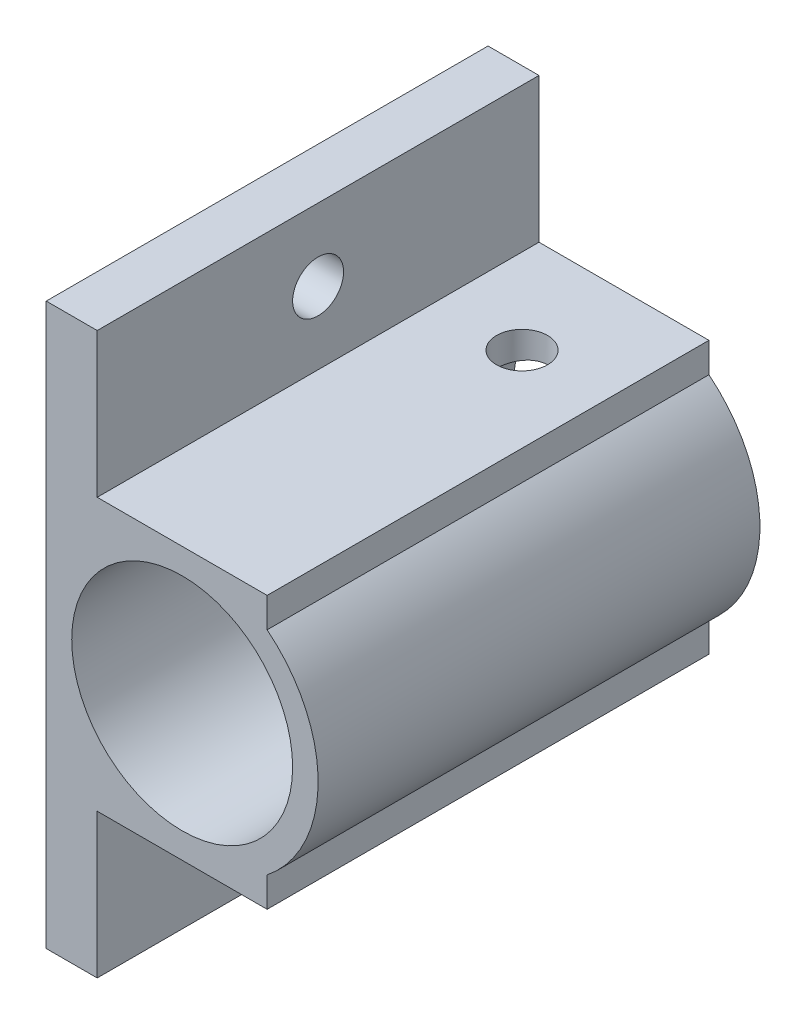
from build123d import *

# Parameters (mm, degrees)
BOSS_EXTRUDE1_DEPTH = 26
SKETCH7_R           = 1.5
CUT_EXTRUDE3_DEPTH  = 4
SKETCH8_R           = 1.5
CUT_EXTRUDE4_DEPTH  = 4


with BuildPart() as part:
    # Sketch1 → Boss-Extrude1 (new body)
    with BuildSketch(Plane.XY):
        with BuildLine():
            Line((-5, 6.244997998), (-5, 8))
            Line((-5, 8), (-5, 16.5))
            Line((-5, 16.5), (-8, 16.5))
            Line((-8, 16.5), (-8, 9e-09))
            ThreePointArc((-8, 9e-09), (-7.211102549, 3.464101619), (-5, 6.244997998))
        make_face()
        with BuildLine():
            ThreePointArc((-5, -6.244997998), (-7.211102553, -3.464101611), (-8, 9e-09))
            Line((-8, 9e-09), (-8, -16.5))
            Line((-8, -16.5), (-5, -16.5))
            Line((-5, -16.5), (-5, -8))
            Line((-5, -8), (-5, -6.244997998))
        make_face()
        with BuildLine():
            Line((-5, 4.153311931), (-5, 6.244997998))
            ThreePointArc((-5, 6.244997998), (-7.211102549, 3.464101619), (-8, 9e-09))
            ThreePointArc((-8, 9e-09), (-7.211102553, -3.464101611), (-5, -6.244997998))
            Line((-5, -6.244997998), (-5, -4.153311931))
            ThreePointArc((-5, -4.153311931), (-6.5, 0), (-5, 4.153311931))
        make_face()
        with BuildLine():
            ThreePointArc((0, 8), (-2.649529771, 7.548509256), (-5, 6.244997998))
            Line((-5, 6.244997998), (-5, 4.153311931))
            ThreePointArc((-5, 4.153311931), (0, 6.5), (5, 4.153311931))
            Line((5, 4.153311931), (5, 6.244997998))
            ThreePointArc((5, 6.244997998), (2.649529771, 7.548509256), (0, 8))
        make_face()
        with BuildLine():
            ThreePointArc((5, -4.153311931), (0, -6.5), (-5, -4.153311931))
            Line((-5, -4.153311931), (-5, -6.244997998))
            ThreePointArc((-5, -6.244997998), (-2.649529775, -7.548509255), (-9e-09, -8))
            ThreePointArc((-9e-09, -8), (2.649529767, -7.548509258), (5, -6.244997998))
            Line((5, -6.244997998), (5, -4.153311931))
        make_face()
        with BuildLine():
            ThreePointArc((8, 0), (7.211102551, 3.464101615), (5, 6.244997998))
            Line((5, 6.244997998), (5, 4.153311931))
            ThreePointArc((5, 4.153311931), (6.11350963, 2.207940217), (6.5, 0))
            ThreePointArc((6.5, 0), (6.11350963, -2.207940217), (5, -4.153311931))
            Line((5, -4.153311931), (5, -6.244997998))
            ThreePointArc((5, -6.244997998), (7.211102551, -3.464101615), (8, 0))
        make_face()
        with BuildLine():
            ThreePointArc((0, 8), (-2.649529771, 7.548509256), (-5, 6.244997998))
            Line((-5, 6.244997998), (-5, 4.153311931))
            ThreePointArc((-5, 4.153311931), (0, 6.5), (5, 4.153311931))
            Line((5, 4.153311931), (5, 6.244997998))
            ThreePointArc((5, 6.244997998), (2.649529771, 7.548509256), (0, 8))
        make_face()
        with BuildLine():
            ThreePointArc((5, -4.153311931), (0, -6.5), (-5, -4.153311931))
            Line((-5, -4.153311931), (-5, -6.244997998))
            ThreePointArc((-5, -6.244997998), (-2.649529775, -7.548509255), (-9e-09, -8))
            ThreePointArc((-9e-09, -8), (2.649529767, -7.548509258), (5, -6.244997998))
            Line((5, -6.244997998), (5, -4.153311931))
        make_face()
        with BuildLine():
            ThreePointArc((-9e-09, -8), (-2.649529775, -7.548509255), (-5, -6.244997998))
            Line((-5, -6.244997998), (-5, -8))
            Line((-5, -8), (-9e-09, -8))
        make_face()
        with BuildLine():
            ThreePointArc((5, -6.244997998), (2.649529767, -7.548509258), (-9e-09, -8))
            Line((-9e-09, -8), (5, -8))
            Line((5, -8), (5, -6.244997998))
        make_face()
        with BuildLine():
            Line((5, 8), (0, 8))
            ThreePointArc((0, 8), (2.649529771, 7.548509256), (5, 6.244997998))
            Line((5, 6.244997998), (5, 8))
        make_face()
        with BuildLine():
            Line((0, 8), (-5, 8))
            Line((-5, 8), (-5, 6.244997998))
            ThreePointArc((-5, 6.244997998), (-2.649529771, 7.548509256), (0, 8))
        make_face()
    extrude(amount=BOSS_EXTRUDE1_DEPTH)

    # Sketch7 → Cut-Extrude3 (cut)
    with BuildSketch(Plane(origin=(0, 8, 0), x_dir=(1, 0, 0), z_dir=(0, 1, 0))):
        with Locations(Location((0, -6, 0), (0, 0, 270))):
            Circle(SKETCH7_R)
    extrude(amount=-CUT_EXTRUDE3_DEPTH, mode=Mode.SUBTRACT)

    # Sketch8 → Cut-Extrude4 (cut)
    with BuildSketch(Plane(origin=(-5, 0, 0), x_dir=(0, 0, -1), z_dir=(1, 0, 0))):
        with Locations(Location((-13, 12.25, 0), (0, 0, 90))):
            Circle(SKETCH8_R)
        with Locations(Location((-13, -12.25, 0), (0, 0, 90))):
            Circle(SKETCH8_R)
    extrude(amount=-CUT_EXTRUDE4_DEPTH, mode=Mode.SUBTRACT)


solid = part.part
